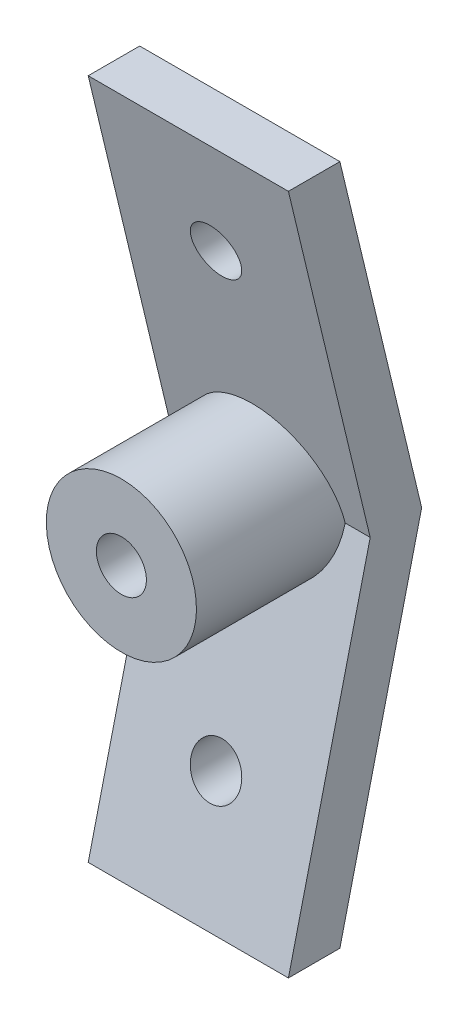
ISO-10303-21;
HEADER;
FILE_DESCRIPTION(('STEP AP214'),'2;1');
FILE_NAME('part.step','',(''),(''),'','','');
FILE_SCHEMA(('AUTOMOTIVE_DESIGN { 1 0 10303 214 1 1 1 1 }'));
ENDSEC;
DATA;
#1=APPLICATION_CONTEXT('core data for automotive mechanical design processes');
#2=APPLICATION_PROTOCOL_DEFINITION('international standard','automotive_design',2000,#1);
#3=PRODUCT_CONTEXT('',#1,'mechanical');
#4=PRODUCT('Part','Part','',(#3));
#5=PRODUCT_RELATED_PRODUCT_CATEGORY('part','',(#4));
#6=PRODUCT_DEFINITION_FORMATION('','',#4);
#7=PRODUCT_DEFINITION_CONTEXT('part definition',#1,'design');
#8=PRODUCT_DEFINITION('design','',#6,#7);
#9=PRODUCT_DEFINITION_SHAPE('','',#8);
#10=(LENGTH_UNIT() NAMED_UNIT(*) SI_UNIT(.MILLI.,.METRE.));
#11=(NAMED_UNIT(*) PLANE_ANGLE_UNIT() SI_UNIT($,.RADIAN.));
#12=(NAMED_UNIT(*) SI_UNIT($,.STERADIAN.) SOLID_ANGLE_UNIT());
#13=UNCERTAINTY_MEASURE_WITH_UNIT(LENGTH_MEASURE(1.E-05),#10,'distance_accuracy_value','');
#14=(GEOMETRIC_REPRESENTATION_CONTEXT(3) GLOBAL_UNCERTAINTY_ASSIGNED_CONTEXT((#13)) GLOBAL_UNIT_ASSIGNED_CONTEXT((#10,
#11,#12)) REPRESENTATION_CONTEXT('',''));
#15=CARTESIAN_POINT('',(0.,0.,0.));
#16=DIRECTION('',(0.,0.,1.));
#17=DIRECTION('',(1.,0.,0.));
#18=AXIS2_PLACEMENT_3D('',#15,#16,#17);
#19=CARTESIAN_POINT('',(-2.,-6.80658944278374,1.63411754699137));
#20=DIRECTION('',(0.,-0.233445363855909,-0.972369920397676));
#21=DIRECTION('',(0.,0.972369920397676,-0.233445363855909));
#22=AXIS2_PLACEMENT_3D('',#19,#20,#21);
#23=PLANE('',#22);
#24=DIRECTION('',(1.,0.,0.));
#25=VECTOR('',#24,1.);
#26=CARTESIAN_POINT('',(-2.,0.,0.));
#27=LINE('',#26,#25);
#28=CARTESIAN_POINT('',(-2.,0.,0.));
#29=VERTEX_POINT('',#28);
#30=CARTESIAN_POINT('',(2.,0.,0.));
#31=VERTEX_POINT('',#30);
#32=EDGE_CURVE('E92',#29,#31,#27,.T.);
#33=ORIENTED_EDGE('',*,*,#32,.T.);
#34=DIRECTION('',(0.,0.972369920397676,-0.233445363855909));
#35=VECTOR('',#34,1.);
#36=CARTESIAN_POINT('',(2.,-6.80658944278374,1.63411754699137));
#37=LINE('',#36,#35);
#38=CARTESIAN_POINT('',(2.,-6.80658944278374,1.63411754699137));
#39=VERTEX_POINT('',#38);
#40=EDGE_CURVE('E96',#39,#31,#37,.T.);
#41=ORIENTED_EDGE('',*,*,#40,.F.);
#42=DIRECTION('',(1.,0.,0.));
#43=VECTOR('',#42,1.);
#44=CARTESIAN_POINT('',(-2.,-6.80658944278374,1.63411754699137));
#45=LINE('',#44,#43);
#46=CARTESIAN_POINT('',(-2.,-6.80658944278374,1.63411754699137));
#47=VERTEX_POINT('',#46);
#48=EDGE_CURVE('E12',#47,#39,#45,.T.);
#49=ORIENTED_EDGE('',*,*,#48,.F.);
#50=DIRECTION('',(0.,0.972369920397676,-0.233445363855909));
#51=VECTOR('',#50,1.);
#52=CARTESIAN_POINT('',(-2.,-6.80658944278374,1.63411754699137));
#53=LINE('',#52,#51);
#54=EDGE_CURVE('E97',#47,#29,#53,.T.);
#55=ORIENTED_EDGE('',*,*,#54,.T.);
#56=EDGE_LOOP('',(#33,#41,#49,#55));
#57=FACE_BOUND('',#56,.T.);
#58=CARTESIAN_POINT('',(0.,-4.5,1.08035441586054));
#59=DIRECTION('',(0.,-0.233445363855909,-0.972369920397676));
#60=DIRECTION('',(0.,0.972369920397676,-0.233445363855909));
#61=AXIS2_PLACEMENT_3D('',#58,#59,#60);
#62=ELLIPSE('',#61,0.514207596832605,0.5);
#63=CARTESIAN_POINT('',(0.,-4.,0.960315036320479));
#64=VERTEX_POINT('',#63);
#65=EDGE_CURVE('E149',#64,#64,#62,.F.);
#66=ORIENTED_EDGE('',*,*,#65,.T.);
#67=EDGE_LOOP('',(#66));
#68=FACE_BOUND('',#67,.T.);
#69=ADVANCED_FACE('F42',(#57,#68),#23,.T.);
#70=CARTESIAN_POINT('',(-2.,0.,1.02841519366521));
#71=DIRECTION('',(0.,0.233445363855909,0.972369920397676));
#72=DIRECTION('',(0.,-0.972369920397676,0.233445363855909));
#73=AXIS2_PLACEMENT_3D('',#70,#71,#72);
#74=PLANE('',#73);
#75=DIRECTION('',(1.,0.,0.));
#76=VECTOR('',#75,1.);
#77=CARTESIAN_POINT('',(-2.,-6.80658944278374,2.66253274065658));
#78=LINE('',#77,#76);
#79=CARTESIAN_POINT('',(-2.,-6.80658944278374,2.66253274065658));
#80=VERTEX_POINT('',#79);
#81=CARTESIAN_POINT('',(2.,-6.80658944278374,2.66253274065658));
#82=VERTEX_POINT('',#81);
#83=EDGE_CURVE('E50',#80,#82,#78,.T.);
#84=ORIENTED_EDGE('',*,*,#83,.T.);
#85=DIRECTION('',(0.,-0.972369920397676,0.233445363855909));
#86=VECTOR('',#85,1.);
#87=CARTESIAN_POINT('',(2.,0.,1.02841519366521));
#88=LINE('',#87,#86);
#89=CARTESIAN_POINT('',(2.,0.,1.02841519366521));
#90=VERTEX_POINT('',#89);
#91=EDGE_CURVE('E128',#90,#82,#88,.T.);
#92=ORIENTED_EDGE('',*,*,#91,.F.);
#93=DIRECTION('',(1.,0.,0.));
#94=VECTOR('',#93,1.);
#95=CARTESIAN_POINT('',(-2.,0.,1.02841519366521));
#96=LINE('',#95,#94);
#97=CARTESIAN_POINT('',(-2.,0.,1.02841519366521));
#98=VERTEX_POINT('',#97);
#99=EDGE_CURVE('E144',#98,#90,#96,.T.);
#100=ORIENTED_EDGE('',*,*,#99,.F.);
#101=DIRECTION('',(0.,-0.972369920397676,0.233445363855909));
#102=VECTOR('',#101,1.);
#103=CARTESIAN_POINT('',(-2.,0.,1.02841519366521));
#104=LINE('',#103,#102);
#105=EDGE_CURVE('E140',#98,#80,#104,.T.);
#106=ORIENTED_EDGE('',*,*,#105,.T.);
#107=EDGE_LOOP('',(#84,#92,#100,#106));
#108=FACE_BOUND('',#107,.T.);
#109=CARTESIAN_POINT('',(0.,-4.5,2.10876960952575));
#110=DIRECTION('',(0.,0.233445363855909,0.972369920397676));
#111=DIRECTION('',(0.,0.972369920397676,-0.233445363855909));
#112=AXIS2_PLACEMENT_3D('',#109,#110,#111);
#113=ELLIPSE('',#112,0.514207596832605,0.5);
#114=CARTESIAN_POINT('',(0.,-4.,1.98873022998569));
#115=VERTEX_POINT('',#114);
#116=EDGE_CURVE('E45',#115,#115,#113,.F.);
#117=ORIENTED_EDGE('',*,*,#116,.T.);
#118=EDGE_LOOP('',(#117));
#119=FACE_BOUND('',#118,.T.);
#120=ADVANCED_FACE('F156',(#108,#119),#74,.T.);
#121=CARTESIAN_POINT('',(-2.,6.80658944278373,2.66253274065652));
#122=DIRECTION('',(0.,-0.233445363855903,0.972369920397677));
#123=DIRECTION('',(0.,-0.972369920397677,-0.233445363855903));
#124=AXIS2_PLACEMENT_3D('',#121,#122,#123);
#125=PLANE('',#124);
#126=ORIENTED_EDGE('',*,*,#99,.T.);
#127=DIRECTION('',(0.,-0.972369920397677,-0.233445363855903));
#128=VECTOR('',#127,1.);
#129=CARTESIAN_POINT('',(2.,6.80658944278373,2.66253274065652));
#130=LINE('',#129,#128);
#131=CARTESIAN_POINT('',(2.,6.80658944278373,2.66253274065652));
#132=VERTEX_POINT('',#131);
#133=EDGE_CURVE('E125',#132,#90,#130,.T.);
#134=ORIENTED_EDGE('',*,*,#133,.F.);
#135=DIRECTION('',(1.,0.,0.));
#136=VECTOR('',#135,1.);
#137=CARTESIAN_POINT('',(-2.,6.80658944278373,2.66253274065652));
#138=LINE('',#137,#136);
#139=CARTESIAN_POINT('',(-2.,6.80658944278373,2.66253274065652));
#140=VERTEX_POINT('',#139);
#141=EDGE_CURVE('E146',#140,#132,#138,.T.);
#142=ORIENTED_EDGE('',*,*,#141,.F.);
#143=DIRECTION('',(0.,-0.972369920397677,-0.233445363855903));
#144=VECTOR('',#143,1.);
#145=CARTESIAN_POINT('',(-2.,6.80658944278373,2.66253274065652));
#146=LINE('',#145,#144);
#147=EDGE_CURVE('E137',#140,#98,#146,.T.);
#148=ORIENTED_EDGE('',*,*,#147,.T.);
#149=EDGE_LOOP('',(#126,#134,#142,#148));
#150=FACE_BOUND('',#149,.T.);
#151=CARTESIAN_POINT('',(0.,4.5,2.10876960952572));
#152=DIRECTION('',(0.,-0.233445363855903,0.972369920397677));
#153=DIRECTION('',(0.,-0.972369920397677,-0.233445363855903));
#154=AXIS2_PLACEMENT_3D('',#151,#152,#153);
#155=ELLIPSE('',#154,0.514207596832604,0.5);
#156=CARTESIAN_POINT('',(0.,4.,1.98873022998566));
#157=VERTEX_POINT('',#156);
#158=EDGE_CURVE('E117',#157,#157,#155,.F.);
#159=ORIENTED_EDGE('',*,*,#158,.T.);
#160=EDGE_LOOP('',(#159));
#161=FACE_BOUND('',#160,.T.);
#162=ADVANCED_FACE('F172',(#150,#161),#125,.T.);
#163=CARTESIAN_POINT('',(-2.,0.,0.));
#164=DIRECTION('',(0.,0.233445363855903,-0.972369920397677));
#165=DIRECTION('',(0.,0.972369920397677,0.233445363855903));
#166=AXIS2_PLACEMENT_3D('',#163,#164,#165);
#167=PLANE('',#166);
#168=DIRECTION('',(1.,0.,0.));
#169=VECTOR('',#168,1.);
#170=CARTESIAN_POINT('',(-2.,6.80658944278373,1.63411754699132));
#171=LINE('',#170,#169);
#172=CARTESIAN_POINT('',(-2.,6.80658944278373,1.63411754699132));
#173=VERTEX_POINT('',#172);
#174=CARTESIAN_POINT('',(2.,6.80658944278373,1.63411754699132));
#175=VERTEX_POINT('',#174);
#176=EDGE_CURVE('E101',#173,#175,#171,.T.);
#177=ORIENTED_EDGE('',*,*,#176,.T.);
#178=DIRECTION('',(0.,0.972369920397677,0.233445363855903));
#179=VECTOR('',#178,1.);
#180=CARTESIAN_POINT('',(2.,0.,0.));
#181=LINE('',#180,#179);
#182=EDGE_CURVE('E105',#31,#175,#181,.T.);
#183=ORIENTED_EDGE('',*,*,#182,.F.);
#184=ORIENTED_EDGE('',*,*,#32,.F.);
#185=DIRECTION('',(0.,0.972369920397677,0.233445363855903));
#186=VECTOR('',#185,1.);
#187=CARTESIAN_POINT('',(-2.,0.,0.));
#188=LINE('',#187,#186);
#189=EDGE_CURVE('E132',#29,#173,#188,.T.);
#190=ORIENTED_EDGE('',*,*,#189,.T.);
#191=EDGE_LOOP('',(#177,#183,#184,#190));
#192=FACE_BOUND('',#191,.T.);
#193=CARTESIAN_POINT('',(0.,4.5,1.08035441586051));
#194=DIRECTION('',(0.,0.233445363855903,-0.972369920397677));
#195=DIRECTION('',(0.,-0.972369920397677,-0.233445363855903));
#196=AXIS2_PLACEMENT_3D('',#193,#194,#195);
#197=ELLIPSE('',#196,0.514207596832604,0.5);
#198=CARTESIAN_POINT('',(0.,4.,0.960315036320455));
#199=VERTEX_POINT('',#198);
#200=EDGE_CURVE('E120',#199,#199,#197,.F.);
#201=ORIENTED_EDGE('',*,*,#200,.T.);
#202=EDGE_LOOP('',(#201));
#203=FACE_BOUND('',#202,.T.);
#204=ADVANCED_FACE('F106',(#192,#203),#167,.T.);
#205=CARTESIAN_POINT('',(-2.,-6.80658944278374,2.66253274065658));
#206=DIRECTION('',(0.,-1.,0.));
#207=DIRECTION('',(0.,0.,-1.));
#208=AXIS2_PLACEMENT_3D('',#205,#206,#207);
#209=PLANE('',#208);
#210=ORIENTED_EDGE('',*,*,#48,.T.);
#211=DIRECTION('',(0.,0.,-1.));
#212=VECTOR('',#211,1.);
#213=CARTESIAN_POINT('',(2.,-6.80658944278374,2.66253274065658));
#214=LINE('',#213,#212);
#215=EDGE_CURVE('E116',#82,#39,#214,.T.);
#216=ORIENTED_EDGE('',*,*,#215,.F.);
#217=ORIENTED_EDGE('',*,*,#83,.F.);
#218=DIRECTION('',(0.,0.,-1.));
#219=VECTOR('',#218,1.);
#220=CARTESIAN_POINT('',(-2.,-6.80658944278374,2.66253274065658));
#221=LINE('',#220,#219);
#222=EDGE_CURVE('E102',#80,#47,#221,.T.);
#223=ORIENTED_EDGE('',*,*,#222,.T.);
#224=EDGE_LOOP('',(#210,#216,#217,#223));
#225=FACE_BOUND('',#224,.T.);
#226=ADVANCED_FACE('F181',(#225),#209,.T.);
#227=CARTESIAN_POINT('',(-2.,6.80658944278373,1.63411754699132));
#228=DIRECTION('',(0.,1.,0.));
#229=DIRECTION('',(0.,0.,1.));
#230=AXIS2_PLACEMENT_3D('',#227,#228,#229);
#231=PLANE('',#230);
#232=ORIENTED_EDGE('',*,*,#141,.T.);
#233=DIRECTION('',(0.,0.,1.));
#234=VECTOR('',#233,1.);
#235=CARTESIAN_POINT('',(2.,6.80658944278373,1.63411754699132));
#236=LINE('',#235,#234);
#237=EDGE_CURVE('E111',#175,#132,#236,.T.);
#238=ORIENTED_EDGE('',*,*,#237,.F.);
#239=ORIENTED_EDGE('',*,*,#176,.F.);
#240=DIRECTION('',(0.,0.,1.));
#241=VECTOR('',#240,1.);
#242=CARTESIAN_POINT('',(-2.,6.80658944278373,1.63411754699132));
#243=LINE('',#242,#241);
#244=EDGE_CURVE('E134',#173,#140,#243,.T.);
#245=ORIENTED_EDGE('',*,*,#244,.T.);
#246=EDGE_LOOP('',(#232,#238,#239,#245));
#247=FACE_BOUND('',#246,.T.);
#248=ADVANCED_FACE('F184',(#247),#231,.T.);
#249=CARTESIAN_POINT('',(-2.,6.80658944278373,-1.63411754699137));
#250=DIRECTION('',(1.,0.,0.));
#251=DIRECTION('',(0.,0.,-1.));
#252=AXIS2_PLACEMENT_3D('',#249,#250,#251);
#253=PLANE('',#252);
#254=ORIENTED_EDGE('',*,*,#54,.F.);
#255=ORIENTED_EDGE('',*,*,#222,.F.);
#256=ORIENTED_EDGE('',*,*,#105,.F.);
#257=ORIENTED_EDGE('',*,*,#147,.F.);
#258=ORIENTED_EDGE('',*,*,#244,.F.);
#259=ORIENTED_EDGE('',*,*,#189,.F.);
#260=EDGE_LOOP('',(#254,#255,#256,#257,#258,#259));
#261=FACE_BOUND('',#260,.T.);
#262=ADVANCED_FACE('F186',(#261),#253,.F.);
#263=CARTESIAN_POINT('',(2.,6.80658944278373,-1.63411754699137));
#264=DIRECTION('',(1.,0.,0.));
#265=DIRECTION('',(0.,0.,-1.));
#266=AXIS2_PLACEMENT_3D('',#263,#264,#265);
#267=PLANE('',#266);
#268=ORIENTED_EDGE('',*,*,#40,.T.);
#269=ORIENTED_EDGE('',*,*,#182,.T.);
#270=ORIENTED_EDGE('',*,*,#237,.T.);
#271=ORIENTED_EDGE('',*,*,#133,.T.);
#272=ORIENTED_EDGE('',*,*,#91,.T.);
#273=ORIENTED_EDGE('',*,*,#215,.T.);
#274=EDGE_LOOP('',(#268,#269,#270,#271,#272,#273));
#275=FACE_BOUND('',#274,.T.);
#276=ADVANCED_FACE('F114',(#275),#267,.T.);
#277=CARTESIAN_POINT('',(0.,4.5,10.));
#278=DIRECTION('',(0.,0.,-1.));
#279=DIRECTION('',(-1.,0.,0.));
#280=AXIS2_PLACEMENT_3D('',#277,#278,#279);
#281=CYLINDRICAL_SURFACE('',#280,0.5);
#282=ORIENTED_EDGE('',*,*,#158,.F.);
#283=EDGE_LOOP('',(#282));
#284=FACE_BOUND('',#283,.T.);
#285=ORIENTED_EDGE('',*,*,#200,.F.);
#286=EDGE_LOOP('',(#285));
#287=FACE_BOUND('',#286,.T.);
#288=ADVANCED_FACE('F160',(#284,#287),#281,.F.);
#289=CARTESIAN_POINT('',(0.,-4.5,10.));
#290=DIRECTION('',(0.,0.,-1.));
#291=DIRECTION('',(-1.,0.,0.));
#292=AXIS2_PLACEMENT_3D('',#289,#290,#291);
#293=CYLINDRICAL_SURFACE('',#292,0.5);
#294=ORIENTED_EDGE('',*,*,#65,.F.);
#295=EDGE_LOOP('',(#294));
#296=FACE_BOUND('',#295,.T.);
#297=ORIENTED_EDGE('',*,*,#116,.F.);
#298=EDGE_LOOP('',(#297));
#299=FACE_BOUND('',#298,.T.);
#300=ADVANCED_FACE('F158',(#296,#299),#293,.F.);
#301=CLOSED_SHELL('',(#69,#120,#162,#204,#226,#248,#262,#276,#288,#300));
#302=MANIFOLD_SOLID_BREP('B2',#301);
#303=CARTESIAN_POINT('',(0.,0.,2.));
#304=DIRECTION('',(0.,0.,1.));
#305=DIRECTION('',(0.,-1.,0.));
#306=AXIS2_PLACEMENT_3D('',#303,#304,#305);
#307=PLANE('',#306);
#308=CARTESIAN_POINT('',(0.,0.,2.));
#309=DIRECTION('',(0.,0.,-1.));
#310=DIRECTION('',(0.,1.,0.));
#311=AXIS2_PLACEMENT_3D('',#308,#309,#310);
#312=CIRCLE('',#311,0.5);
#313=CARTESIAN_POINT('',(0.,0.49999999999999,2.));
#314=VERTEX_POINT('',#313);
#315=EDGE_CURVE('E292',#314,#314,#312,.T.);
#316=ORIENTED_EDGE('',*,*,#315,.F.);
#317=EDGE_LOOP('',(#316));
#318=FACE_BOUND('',#317,.T.);
#319=ADVANCED_FACE('F259',(#318),#307,.T.);
#320=CARTESIAN_POINT('',(0.,0.,0.));
#321=DIRECTION('',(0.,0.,1.));
#322=DIRECTION('',(0.,-1.,0.));
#323=AXIS2_PLACEMENT_3D('',#320,#321,#322);
#324=CONICAL_SURFACE('',#323,0.,1.33517687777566);
#325=CARTESIAN_POINT('',(0.,0.,0.360118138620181));
#326=DIRECTION('',(0.,0.,-1.));
#327=DIRECTION('',(0.,1.,0.));
#328=AXIS2_PLACEMENT_3D('',#325,#326,#327);
#329=CIRCLE('',#328,1.50000000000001);
#330=CARTESIAN_POINT('',(0.,1.5,0.360118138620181));
#331=VERTEX_POINT('',#330);
#332=EDGE_CURVE('E40',#331,#331,#329,.T.);
#333=ORIENTED_EDGE('',*,*,#332,.T.);
#334=EDGE_LOOP('',(#333));
#335=FACE_BOUND('',#334,.T.);
#336=CARTESIAN_POINT('',(0.,0.,0.));
#337=VERTEX_POINT('',#336);
#338=VERTEX_LOOP('',#337);
#339=FACE_BOUND('',#338,.T.);
#340=ADVANCED_FACE('F268',(#335,#339),#324,.T.);
#341=CARTESIAN_POINT('',(0.,0.,0.));
#342=DIRECTION('',(0.,0.,-1.));
#343=DIRECTION('',(0.,1.,0.));
#344=AXIS2_PLACEMENT_3D('',#341,#342,#343);
#345=CYLINDRICAL_SURFACE('',#344,1.50000000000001);
#346=CARTESIAN_POINT('',(0.,0.,4.));
#347=DIRECTION('',(0.,0.,-1.));
#348=DIRECTION('',(0.,1.,0.));
#349=AXIS2_PLACEMENT_3D('',#346,#347,#348);
#350=CIRCLE('',#349,1.50000000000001);
#351=CARTESIAN_POINT('',(0.,1.5,4.));
#352=VERTEX_POINT('',#351);
#353=EDGE_CURVE('E265',#352,#352,#350,.T.);
#354=ORIENTED_EDGE('',*,*,#353,.T.);
#355=EDGE_LOOP('',(#354));
#356=FACE_BOUND('',#355,.T.);
#357=ORIENTED_EDGE('',*,*,#332,.F.);
#358=EDGE_LOOP('',(#357));
#359=FACE_BOUND('',#358,.T.);
#360=ADVANCED_FACE('F270',(#356,#359),#345,.T.);
#361=CARTESIAN_POINT('',(0.,0.49999999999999,4.));
#362=DIRECTION('',(0.,0.,1.));
#363=DIRECTION('',(0.,-1.,0.));
#364=AXIS2_PLACEMENT_3D('',#361,#362,#363);
#365=PLANE('',#364);
#366=CARTESIAN_POINT('',(0.,0.,4.));
#367=DIRECTION('',(0.,0.,-1.));
#368=DIRECTION('',(0.,1.,0.));
#369=AXIS2_PLACEMENT_3D('',#366,#367,#368);
#370=CIRCLE('',#369,0.5);
#371=CARTESIAN_POINT('',(0.,0.49999999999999,4.));
#372=VERTEX_POINT('',#371);
#373=EDGE_CURVE('E295',#372,#372,#370,.T.);
#374=ORIENTED_EDGE('',*,*,#373,.T.);
#375=EDGE_LOOP('',(#374));
#376=FACE_BOUND('',#375,.T.);
#377=ORIENTED_EDGE('',*,*,#353,.F.);
#378=EDGE_LOOP('',(#377));
#379=FACE_BOUND('',#378,.T.);
#380=ADVANCED_FACE('F276',(#376,#379),#365,.T.);
#381=CARTESIAN_POINT('',(0.,0.,0.));
#382=DIRECTION('',(0.,0.,-1.));
#383=DIRECTION('',(0.,1.,0.));
#384=AXIS2_PLACEMENT_3D('',#381,#382,#383);
#385=CYLINDRICAL_SURFACE('',#384,0.5);
#386=ORIENTED_EDGE('',*,*,#315,.T.);
#387=EDGE_LOOP('',(#386));
#388=FACE_BOUND('',#387,.T.);
#389=ORIENTED_EDGE('',*,*,#373,.F.);
#390=EDGE_LOOP('',(#389));
#391=FACE_BOUND('',#390,.T.);
#392=ADVANCED_FACE('F283',(#388,#391),#385,.F.);
#393=CLOSED_SHELL('',(#319,#340,#360,#380,#392));
#394=MANIFOLD_SOLID_BREP('B6',#393);
#395=ADVANCED_BREP_SHAPE_REPRESENTATION('',(#18,#302,#394),#14);
#396=SHAPE_DEFINITION_REPRESENTATION(#9,#395);
ENDSEC;
END-ISO-10303-21;
